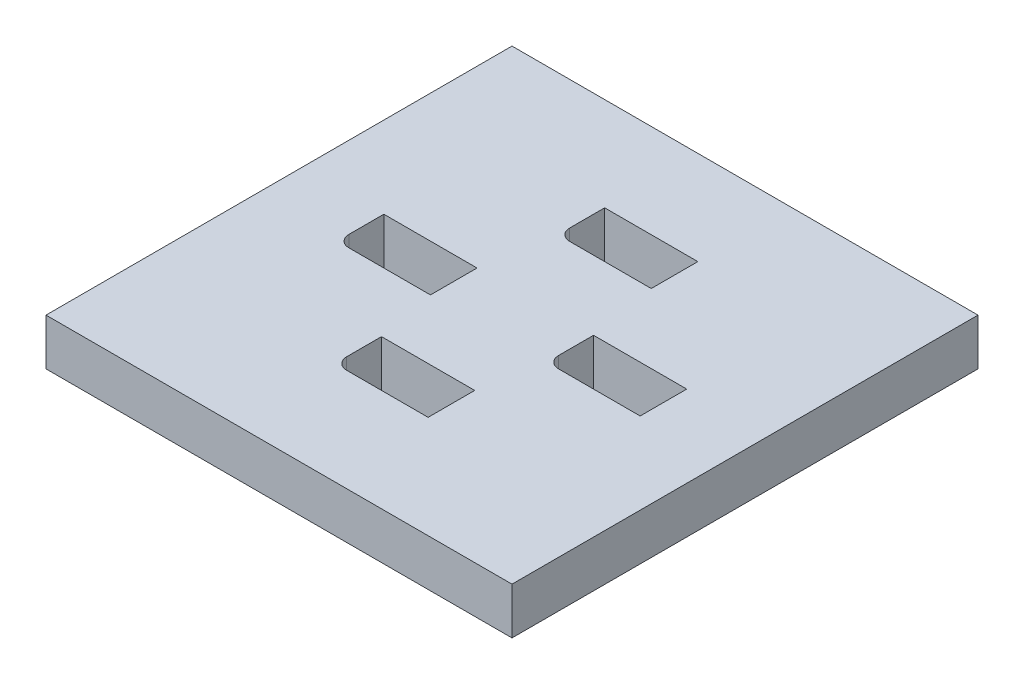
from build123d import *

# Parameters (mm, degrees)
SKETCH1_W           = 127
SKETCH1_H           = 127
BOSS_EXTRUDE1_DEPTH = 12.7
CUT_EXTRUDE1_DEPTH  = 91.696141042


with BuildPart() as part:
    # Sketch1 → Boss-Extrude1 (new body)
    with BuildSketch(Plane(origin=(0, 0, 0), x_dir=(1, 0, 0), z_dir=(0, 1, 0))):
        Rectangle(SKETCH1_W, SKETCH1_H)
    extrude(amount=BOSS_EXTRUDE1_DEPTH)

    # Sketch2 → Cut-Extrude1 (cut, through all)
    with BuildSketch(Plane(origin=(0, 12.7, 0), x_dir=(1, 0, 0), z_dir=(0, 1, 0))):
        with BuildLine():
            Line((12.7, -22.86), (12.7, -35.56))
            Line((12.7, -35.56), (-9.525, -35.56))
            ThreePointArc((-9.525, -35.56), (-11.77006403, -34.63006403), (-12.7, -32.385))
            Line((-12.7, -32.385), (-12.7, -22.86))
            Line((-12.7, -22.86), (12.7, -22.86))
        make_face()
        with BuildLine():
            Line((15.875, 6.35), (41.275, 6.35))
            Line((41.275, 6.35), (41.275, -6.35))
            Line((41.275, -6.35), (19.05, -6.35))
            ThreePointArc((19.05, -6.35), (16.80493597, -5.42006403), (15.875, -3.175))
            Line((15.875, -3.175), (15.875, 6.35))
        make_face()
        with BuildLine():
            Line((-41.275, 6.35), (-41.275, -3.175))
            ThreePointArc((-41.275, -3.175), (-40.34506403, -5.42006403), (-38.1, -6.35))
            Line((-38.1, -6.35), (-15.875, -6.35))
            Line((-15.875, -6.35), (-15.875, 6.35))
            Line((-15.875, 6.35), (-41.275, 6.35))
        make_face()
        with BuildLine():
            Line((12.7, 37.949854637), (12.7, 25.249854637))
            Line((12.7, 25.249854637), (-9.525, 25.249854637))
            ThreePointArc((-9.525, 25.249854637), (-11.77006403, 26.179790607), (-12.7, 28.424854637))
            Line((-12.7, 28.424854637), (-12.7, 37.949854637))
            Line((-12.7, 37.949854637), (12.7, 37.949854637))
        make_face()
    extrude(amount=-CUT_EXTRUDE1_DEPTH, mode=Mode.SUBTRACT)


solid = part.part
